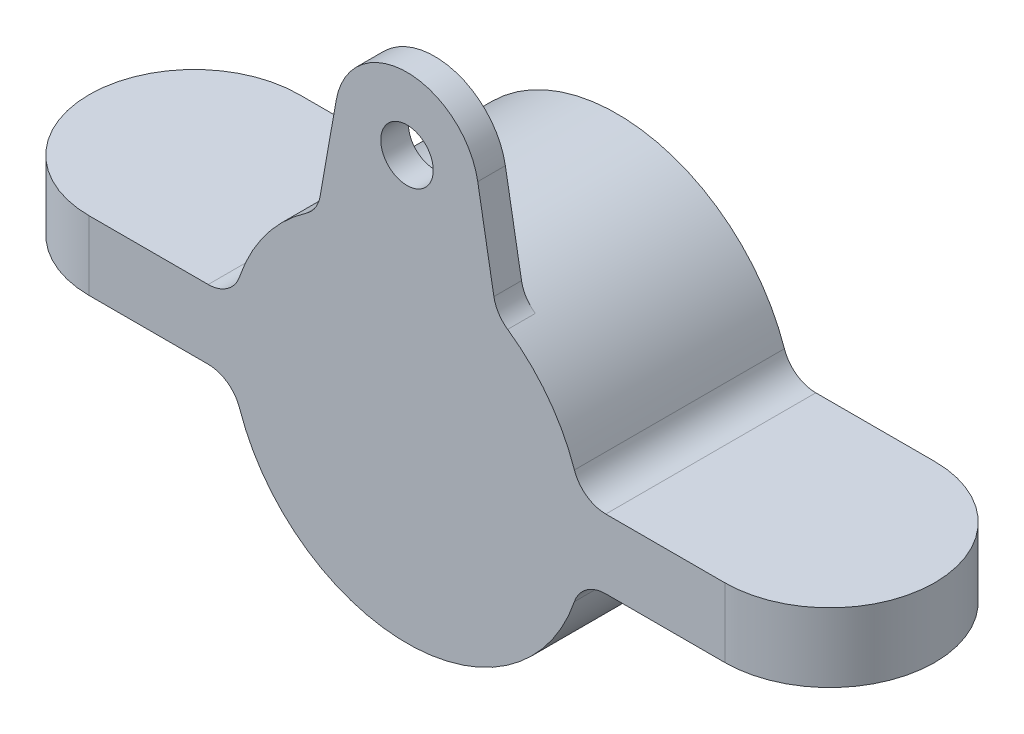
ISO-10303-21;
HEADER;
FILE_DESCRIPTION(('STEP AP214'),'2;1');
FILE_NAME('part.step','',(''),(''),'','','');
FILE_SCHEMA(('AUTOMOTIVE_DESIGN { 1 0 10303 214 1 1 1 1 }'));
ENDSEC;
DATA;
#1=APPLICATION_CONTEXT('core data for automotive mechanical design processes');
#2=APPLICATION_PROTOCOL_DEFINITION('international standard','automotive_design',2000,#1);
#3=PRODUCT_CONTEXT('',#1,'mechanical');
#4=PRODUCT('Part','Part','',(#3));
#5=PRODUCT_RELATED_PRODUCT_CATEGORY('part','',(#4));
#6=PRODUCT_DEFINITION_FORMATION('','',#4);
#7=PRODUCT_DEFINITION_CONTEXT('part definition',#1,'design');
#8=PRODUCT_DEFINITION('design','',#6,#7);
#9=PRODUCT_DEFINITION_SHAPE('','',#8);
#10=(LENGTH_UNIT() NAMED_UNIT(*) SI_UNIT(.MILLI.,.METRE.));
#11=(NAMED_UNIT(*) PLANE_ANGLE_UNIT() SI_UNIT($,.RADIAN.));
#12=(NAMED_UNIT(*) SI_UNIT($,.STERADIAN.) SOLID_ANGLE_UNIT());
#13=UNCERTAINTY_MEASURE_WITH_UNIT(LENGTH_MEASURE(1.E-05),#10,'distance_accuracy_value','');
#14=(GEOMETRIC_REPRESENTATION_CONTEXT(3) GLOBAL_UNCERTAINTY_ASSIGNED_CONTEXT((#13)) GLOBAL_UNIT_ASSIGNED_CONTEXT((#10,
#11,#12)) REPRESENTATION_CONTEXT('',''));
#15=CARTESIAN_POINT('',(0.,0.,0.));
#16=DIRECTION('',(0.,0.,1.));
#17=DIRECTION('',(1.,0.,0.));
#18=AXIS2_PLACEMENT_3D('',#15,#16,#17);
#19=CARTESIAN_POINT('',(-57.5,6.25,-19.));
#20=DIRECTION('',(0.,-1.,0.));
#21=DIRECTION('',(1.,0.,0.));
#22=AXIS2_PLACEMENT_3D('',#19,#20,#21);
#23=CYLINDRICAL_SURFACE('',#22,19.);
#24=DIRECTION('',(0.,-1.,0.));
#25=VECTOR('',#24,1.);
#26=CARTESIAN_POINT('',(-57.5,0.,0.));
#27=LINE('',#26,#25);
#28=CARTESIAN_POINT('',(-57.5,6.25,0.));
#29=VERTEX_POINT('',#28);
#30=CARTESIAN_POINT('',(-57.5,-6.25,0.));
#31=VERTEX_POINT('',#30);
#32=EDGE_CURVE('E240',#29,#31,#27,.T.);
#33=ORIENTED_EDGE('',*,*,#32,.F.);
#34=CARTESIAN_POINT('',(-57.5,6.25,-19.));
#35=DIRECTION('',(0.,1.,0.));
#36=DIRECTION('',(0.,0.,1.));
#37=AXIS2_PLACEMENT_3D('',#34,#35,#36);
#38=CIRCLE('',#37,19.);
#39=CARTESIAN_POINT('',(-57.5,6.25,-38.));
#40=VERTEX_POINT('',#39);
#41=EDGE_CURVE('E246',#40,#29,#38,.T.);
#42=ORIENTED_EDGE('',*,*,#41,.F.);
#43=DIRECTION('',(0.,1.,0.));
#44=VECTOR('',#43,1.);
#45=CARTESIAN_POINT('',(-57.5,6.25,-38.));
#46=LINE('',#45,#44);
#47=CARTESIAN_POINT('',(-57.5,-6.25,-38.));
#48=VERTEX_POINT('',#47);
#49=EDGE_CURVE('E243',#48,#40,#46,.T.);
#50=ORIENTED_EDGE('',*,*,#49,.F.);
#51=CARTESIAN_POINT('',(-57.5,-6.25,-19.));
#52=DIRECTION('',(0.,-1.,0.));
#53=DIRECTION('',(0.,0.,-1.));
#54=AXIS2_PLACEMENT_3D('',#51,#52,#53);
#55=CIRCLE('',#54,19.);
#56=EDGE_CURVE('E249',#31,#48,#55,.T.);
#57=ORIENTED_EDGE('',*,*,#56,.F.);
#58=EDGE_LOOP('',(#33,#42,#50,#57));
#59=FACE_BOUND('',#58,.T.);
#60=ADVANCED_FACE('F34',(#59),#23,.T.);
#61=CARTESIAN_POINT('',(57.5,-6.25,-19.));
#62=DIRECTION('',(0.,1.,0.));
#63=DIRECTION('',(-1.,0.,0.));
#64=AXIS2_PLACEMENT_3D('',#61,#62,#63);
#65=CYLINDRICAL_SURFACE('',#64,19.);
#66=DIRECTION('',(0.,1.,0.));
#67=VECTOR('',#66,1.);
#68=CARTESIAN_POINT('',(57.5,0.,0.));
#69=LINE('',#68,#67);
#70=CARTESIAN_POINT('',(57.5,-6.25,0.));
#71=VERTEX_POINT('',#70);
#72=CARTESIAN_POINT('',(57.5,6.25,0.));
#73=VERTEX_POINT('',#72);
#74=EDGE_CURVE('E214',#71,#73,#69,.T.);
#75=ORIENTED_EDGE('',*,*,#74,.F.);
#76=CARTESIAN_POINT('',(57.5,-6.25,-19.));
#77=DIRECTION('',(0.,-1.,0.));
#78=DIRECTION('',(0.,0.,-1.));
#79=AXIS2_PLACEMENT_3D('',#76,#77,#78);
#80=CIRCLE('',#79,19.);
#81=CARTESIAN_POINT('',(57.5,-6.25,-38.));
#82=VERTEX_POINT('',#81);
#83=EDGE_CURVE('E235',#82,#71,#80,.T.);
#84=ORIENTED_EDGE('',*,*,#83,.F.);
#85=DIRECTION('',(0.,-1.,0.));
#86=VECTOR('',#85,1.);
#87=CARTESIAN_POINT('',(57.5,-6.25,-38.));
#88=LINE('',#87,#86);
#89=CARTESIAN_POINT('',(57.5,6.25,-38.));
#90=VERTEX_POINT('',#89);
#91=EDGE_CURVE('E232',#90,#82,#88,.T.);
#92=ORIENTED_EDGE('',*,*,#91,.F.);
#93=CARTESIAN_POINT('',(57.5,6.25,-19.));
#94=DIRECTION('',(0.,1.,0.));
#95=DIRECTION('',(0.,0.,1.));
#96=AXIS2_PLACEMENT_3D('',#93,#94,#95);
#97=CIRCLE('',#96,19.);
#98=EDGE_CURVE('E238',#73,#90,#97,.T.);
#99=ORIENTED_EDGE('',*,*,#98,.F.);
#100=EDGE_LOOP('',(#75,#84,#92,#99));
#101=FACE_BOUND('',#100,.T.);
#102=ADVANCED_FACE('F319',(#101),#65,.T.);
#103=CARTESIAN_POINT('',(0.,0.,-38.));
#104=DIRECTION('',(0.,0.,1.));
#105=DIRECTION('',(1.,0.,0.));
#106=AXIS2_PLACEMENT_3D('',#103,#104,#105);
#107=CYLINDRICAL_SURFACE('',#106,32.);
#108=CARTESIAN_POINT('',(0.,0.,0.));
#109=DIRECTION('',(0.,0.,1.));
#110=DIRECTION('',(1.,0.,0.));
#111=AXIS2_PLACEMENT_3D('',#108,#109,#110);
#112=CIRCLE('',#111,32.);
#113=CARTESIAN_POINT('',(-18.2153329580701,26.3097252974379,0.));
#114=VERTEX_POINT('',#113);
#115=CARTESIAN_POINT('',(-30.2916570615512,10.3157894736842,0.));
#116=VERTEX_POINT('',#115);
#117=EDGE_CURVE('E196',#114,#116,#112,.T.);
#118=ORIENTED_EDGE('',*,*,#117,.F.);
#119=DIRECTION('',(0.,0.,1.));
#120=VECTOR('',#119,1.);
#121=CARTESIAN_POINT('',(-18.2153329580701,26.3097252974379,-38.));
#122=LINE('',#121,#120);
#123=CARTESIAN_POINT('',(-18.2153329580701,26.3097252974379,-5.));
#124=VERTEX_POINT('',#123);
#125=EDGE_CURVE('E262',#114,#124,#122,.F.);
#126=ORIENTED_EDGE('',*,*,#125,.T.);
#127=CARTESIAN_POINT('',(0.,0.,-5.));
#128=DIRECTION('',(0.,0.,-1.));
#129=DIRECTION('',(1.,0.,0.));
#130=AXIS2_PLACEMENT_3D('',#127,#128,#129);
#131=CIRCLE('',#130,32.);
#132=CARTESIAN_POINT('',(18.2153329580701,26.3097252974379,-5.));
#133=VERTEX_POINT('',#132);
#134=EDGE_CURVE('E172',#124,#133,#131,.T.);
#135=ORIENTED_EDGE('',*,*,#134,.T.);
#136=DIRECTION('',(0.,0.,1.));
#137=VECTOR('',#136,1.);
#138=CARTESIAN_POINT('',(18.2153329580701,26.3097252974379,-38.));
#139=LINE('',#138,#137);
#140=CARTESIAN_POINT('',(18.2153329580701,26.3097252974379,0.));
#141=VERTEX_POINT('',#140);
#142=EDGE_CURVE('E259',#133,#141,#139,.T.);
#143=ORIENTED_EDGE('',*,*,#142,.T.);
#144=CARTESIAN_POINT('',(30.2916570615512,10.3157894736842,0.));
#145=VERTEX_POINT('',#144);
#146=EDGE_CURVE('E217',#145,#141,#112,.T.);
#147=ORIENTED_EDGE('',*,*,#146,.F.);
#148=DIRECTION('',(0.,0.,1.));
#149=VECTOR('',#148,1.);
#150=CARTESIAN_POINT('',(30.2916570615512,10.3157894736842,-38.));
#151=LINE('',#150,#149);
#152=CARTESIAN_POINT('',(30.2916570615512,10.3157894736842,-38.));
#153=VERTEX_POINT('',#152);
#154=EDGE_CURVE('E254',#145,#153,#151,.F.);
#155=ORIENTED_EDGE('',*,*,#154,.T.);
#156=CARTESIAN_POINT('',(0.,0.,-38.));
#157=DIRECTION('',(0.,0.,1.));
#158=DIRECTION('',(1.,0.,0.));
#159=AXIS2_PLACEMENT_3D('',#156,#157,#158);
#160=CIRCLE('',#159,32.);
#161=CARTESIAN_POINT('',(-30.2916570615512,10.3157894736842,-38.));
#162=VERTEX_POINT('',#161);
#163=EDGE_CURVE('E198',#153,#162,#160,.T.);
#164=ORIENTED_EDGE('',*,*,#163,.T.);
#165=DIRECTION('',(0.,0.,1.));
#166=VECTOR('',#165,1.);
#167=CARTESIAN_POINT('',(-30.2916570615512,10.3157894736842,-38.));
#168=LINE('',#167,#166);
#169=EDGE_CURVE('E256',#162,#116,#168,.T.);
#170=ORIENTED_EDGE('',*,*,#169,.T.);
#171=EDGE_LOOP('',(#118,#126,#135,#143,#147,#155,#164,#170));
#172=FACE_BOUND('',#171,.T.);
#173=ADVANCED_FACE('F307',(#172),#107,.T.);
#174=CARTESIAN_POINT('',(31.3837139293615,6.25,-38.));
#175=DIRECTION('',(0.,1.,0.));
#176=DIRECTION('',(0.,0.,1.));
#177=AXIS2_PLACEMENT_3D('',#174,#175,#176);
#178=PLANE('',#177);
#179=DIRECTION('',(-1.,0.,0.));
#180=VECTOR('',#179,1.);
#181=CARTESIAN_POINT('',(31.3837139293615,6.25,-38.));
#182=LINE('',#181,#180);
#183=CARTESIAN_POINT('',(35.9713427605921,6.25,-38.));
#184=VERTEX_POINT('',#183);
#185=EDGE_CURVE('E212',#90,#184,#182,.T.);
#186=ORIENTED_EDGE('',*,*,#185,.T.);
#187=DIRECTION('',(0.,0.,-1.));
#188=VECTOR('',#187,1.);
#189=CARTESIAN_POINT('',(35.9713427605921,6.25,0.));
#190=LINE('',#189,#188);
#191=CARTESIAN_POINT('',(35.9713427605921,6.25,0.));
#192=VERTEX_POINT('',#191);
#193=EDGE_CURVE('E278',#184,#192,#190,.F.);
#194=ORIENTED_EDGE('',*,*,#193,.T.);
#195=DIRECTION('',(-1.,0.,0.));
#196=VECTOR('',#195,1.);
#197=CARTESIAN_POINT('',(31.3837139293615,6.25,0.));
#198=LINE('',#197,#196);
#199=EDGE_CURVE('E202',#73,#192,#198,.T.);
#200=ORIENTED_EDGE('',*,*,#199,.F.);
#201=ORIENTED_EDGE('',*,*,#98,.T.);
#202=EDGE_LOOP('',(#186,#194,#200,#201));
#203=FACE_BOUND('',#202,.T.);
#204=ADVANCED_FACE('F310',(#203),#178,.T.);
#205=CARTESIAN_POINT('',(31.3837139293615,-6.25,-38.));
#206=DIRECTION('',(0.,-1.,0.));
#207=DIRECTION('',(0.,0.,-1.));
#208=AXIS2_PLACEMENT_3D('',#205,#206,#207);
#209=PLANE('',#208);
#210=DIRECTION('',(1.,0.,0.));
#211=VECTOR('',#210,1.);
#212=CARTESIAN_POINT('',(31.3837139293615,-6.25,0.));
#213=LINE('',#212,#211);
#214=CARTESIAN_POINT('',(35.9713427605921,-6.25,0.));
#215=VERTEX_POINT('',#214);
#216=EDGE_CURVE('E226',#215,#71,#213,.T.);
#217=ORIENTED_EDGE('',*,*,#216,.F.);
#218=DIRECTION('',(0.,0.,-1.));
#219=VECTOR('',#218,1.);
#220=CARTESIAN_POINT('',(35.9713427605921,-6.25,-38.));
#221=LINE('',#220,#219);
#222=CARTESIAN_POINT('',(35.9713427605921,-6.25,-38.));
#223=VERTEX_POINT('',#222);
#224=EDGE_CURVE('E276',#215,#223,#221,.T.);
#225=ORIENTED_EDGE('',*,*,#224,.T.);
#226=DIRECTION('',(1.,0.,0.));
#227=VECTOR('',#226,1.);
#228=CARTESIAN_POINT('',(31.3837139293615,-6.25,-38.));
#229=LINE('',#228,#227);
#230=EDGE_CURVE('E210',#223,#82,#229,.T.);
#231=ORIENTED_EDGE('',*,*,#230,.T.);
#232=ORIENTED_EDGE('',*,*,#83,.T.);
#233=EDGE_LOOP('',(#217,#225,#231,#232));
#234=FACE_BOUND('',#233,.T.);
#235=ADVANCED_FACE('F322',(#234),#209,.T.);
#236=CARTESIAN_POINT('',(0.,0.,-38.));
#237=DIRECTION('',(0.,0.,1.));
#238=DIRECTION('',(1.,0.,0.));
#239=AXIS2_PLACEMENT_3D('',#236,#237,#238);
#240=CYLINDRICAL_SURFACE('',#239,32.);
#241=CARTESIAN_POINT('',(0.,0.,0.));
#242=DIRECTION('',(0.,0.,1.));
#243=DIRECTION('',(1.,0.,0.));
#244=AXIS2_PLACEMENT_3D('',#241,#242,#243);
#245=CIRCLE('',#244,32.);
#246=CARTESIAN_POINT('',(-30.2916570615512,-10.3157894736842,0.));
#247=VERTEX_POINT('',#246);
#248=CARTESIAN_POINT('',(30.2916570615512,-10.3157894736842,0.));
#249=VERTEX_POINT('',#248);
#250=EDGE_CURVE('E223',#247,#249,#245,.T.);
#251=ORIENTED_EDGE('',*,*,#250,.F.);
#252=DIRECTION('',(0.,0.,1.));
#253=VECTOR('',#252,1.);
#254=CARTESIAN_POINT('',(-30.2916570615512,-10.3157894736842,-38.));
#255=LINE('',#254,#253);
#256=CARTESIAN_POINT('',(-30.2916570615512,-10.3157894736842,-38.));
#257=VERTEX_POINT('',#256);
#258=EDGE_CURVE('E274',#247,#257,#255,.F.);
#259=ORIENTED_EDGE('',*,*,#258,.T.);
#260=CARTESIAN_POINT('',(0.,0.,-38.));
#261=DIRECTION('',(0.,0.,1.));
#262=DIRECTION('',(1.,0.,0.));
#263=AXIS2_PLACEMENT_3D('',#260,#261,#262);
#264=CIRCLE('',#263,32.);
#265=CARTESIAN_POINT('',(30.2916570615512,-10.3157894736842,-38.));
#266=VERTEX_POINT('',#265);
#267=EDGE_CURVE('E207',#257,#266,#264,.T.);
#268=ORIENTED_EDGE('',*,*,#267,.T.);
#269=DIRECTION('',(0.,0.,1.));
#270=VECTOR('',#269,1.);
#271=CARTESIAN_POINT('',(30.2916570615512,-10.3157894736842,-38.));
#272=LINE('',#271,#270);
#273=EDGE_CURVE('E271',#266,#249,#272,.T.);
#274=ORIENTED_EDGE('',*,*,#273,.T.);
#275=EDGE_LOOP('',(#251,#259,#268,#274));
#276=FACE_BOUND('',#275,.T.);
#277=ADVANCED_FACE('F331',(#276),#240,.T.);
#278=CARTESIAN_POINT('',(-31.3837139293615,-6.25,-38.));
#279=DIRECTION('',(0.,-1.,0.));
#280=DIRECTION('',(0.,0.,-1.));
#281=AXIS2_PLACEMENT_3D('',#278,#279,#280);
#282=PLANE('',#281);
#283=DIRECTION('',(1.,0.,0.));
#284=VECTOR('',#283,1.);
#285=CARTESIAN_POINT('',(-31.3837139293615,-6.25,-38.));
#286=LINE('',#285,#284);
#287=CARTESIAN_POINT('',(-35.9713427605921,-6.25,-38.));
#288=VERTEX_POINT('',#287);
#289=EDGE_CURVE('E204',#48,#288,#286,.T.);
#290=ORIENTED_EDGE('',*,*,#289,.T.);
#291=DIRECTION('',(0.,0.,-1.));
#292=VECTOR('',#291,1.);
#293=CARTESIAN_POINT('',(-35.9713427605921,-6.25,0.));
#294=LINE('',#293,#292);
#295=CARTESIAN_POINT('',(-35.9713427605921,-6.25,0.));
#296=VERTEX_POINT('',#295);
#297=EDGE_CURVE('E268',#288,#296,#294,.F.);
#298=ORIENTED_EDGE('',*,*,#297,.T.);
#299=DIRECTION('',(1.,0.,0.));
#300=VECTOR('',#299,1.);
#301=CARTESIAN_POINT('',(-31.3837139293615,-6.25,0.));
#302=LINE('',#301,#300);
#303=EDGE_CURVE('E220',#31,#296,#302,.T.);
#304=ORIENTED_EDGE('',*,*,#303,.F.);
#305=ORIENTED_EDGE('',*,*,#56,.T.);
#306=EDGE_LOOP('',(#290,#298,#304,#305));
#307=FACE_BOUND('',#306,.T.);
#308=ADVANCED_FACE('F337',(#307),#282,.T.);
#309=CARTESIAN_POINT('',(-31.3837139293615,6.25,-38.));
#310=DIRECTION('',(0.,1.,0.));
#311=DIRECTION('',(0.,0.,1.));
#312=AXIS2_PLACEMENT_3D('',#309,#310,#311);
#313=PLANE('',#312);
#314=DIRECTION('',(-1.,0.,0.));
#315=VECTOR('',#314,1.);
#316=CARTESIAN_POINT('',(-31.3837139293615,6.25,0.));
#317=LINE('',#316,#315);
#318=CARTESIAN_POINT('',(-35.9713427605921,6.25,0.));
#319=VERTEX_POINT('',#318);
#320=EDGE_CURVE('E218',#319,#29,#317,.T.);
#321=ORIENTED_EDGE('',*,*,#320,.F.);
#322=DIRECTION('',(0.,0.,-1.));
#323=VECTOR('',#322,1.);
#324=CARTESIAN_POINT('',(-35.9713427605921,6.25,-38.));
#325=LINE('',#324,#323);
#326=CARTESIAN_POINT('',(-35.9713427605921,6.25,-38.));
#327=VERTEX_POINT('',#326);
#328=EDGE_CURVE('E266',#319,#327,#325,.T.);
#329=ORIENTED_EDGE('',*,*,#328,.T.);
#330=DIRECTION('',(-1.,0.,0.));
#331=VECTOR('',#330,1.);
#332=CARTESIAN_POINT('',(-31.3837139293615,6.25,-38.));
#333=LINE('',#332,#331);
#334=EDGE_CURVE('E201',#327,#40,#333,.T.);
#335=ORIENTED_EDGE('',*,*,#334,.T.);
#336=ORIENTED_EDGE('',*,*,#41,.T.);
#337=EDGE_LOOP('',(#321,#329,#335,#336));
#338=FACE_BOUND('',#337,.T.);
#339=ADVANCED_FACE('F381',(#338),#313,.T.);
#340=CARTESIAN_POINT('',(0.,0.,-38.));
#341=DIRECTION('',(0.,0.,1.));
#342=DIRECTION('',(1.,0.,0.));
#343=AXIS2_PLACEMENT_3D('',#340,#341,#342);
#344=PLANE('',#343);
#345=ORIENTED_EDGE('',*,*,#289,.F.);
#346=ORIENTED_EDGE('',*,*,#49,.T.);
#347=ORIENTED_EDGE('',*,*,#334,.F.);
#348=CARTESIAN_POINT('',(-35.9713427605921,12.25,-38.));
#349=DIRECTION('',(0.,0.,1.));
#350=DIRECTION('',(1.,0.,0.));
#351=AXIS2_PLACEMENT_3D('',#348,#349,#350);
#352=CIRCLE('',#351,6.);
#353=EDGE_CURVE('E290',#327,#162,#352,.T.);
#354=ORIENTED_EDGE('',*,*,#353,.T.);
#355=ORIENTED_EDGE('',*,*,#163,.F.);
#356=CARTESIAN_POINT('',(35.9713427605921,12.25,-38.));
#357=DIRECTION('',(0.,0.,1.));
#358=DIRECTION('',(1.,0.,0.));
#359=AXIS2_PLACEMENT_3D('',#356,#357,#358);
#360=CIRCLE('',#359,6.);
#361=EDGE_CURVE('E11',#153,#184,#360,.T.);
#362=ORIENTED_EDGE('',*,*,#361,.T.);
#363=ORIENTED_EDGE('',*,*,#185,.F.);
#364=ORIENTED_EDGE('',*,*,#91,.T.);
#365=ORIENTED_EDGE('',*,*,#230,.F.);
#366=CARTESIAN_POINT('',(35.9713427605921,-12.25,-38.));
#367=DIRECTION('',(0.,0.,1.));
#368=DIRECTION('',(1.,0.,0.));
#369=AXIS2_PLACEMENT_3D('',#366,#367,#368);
#370=CIRCLE('',#369,6.);
#371=EDGE_CURVE('E298',#223,#266,#370,.T.);
#372=ORIENTED_EDGE('',*,*,#371,.T.);
#373=ORIENTED_EDGE('',*,*,#267,.F.);
#374=CARTESIAN_POINT('',(-35.9713427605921,-12.25,-38.));
#375=DIRECTION('',(0.,0.,1.));
#376=DIRECTION('',(1.,0.,0.));
#377=AXIS2_PLACEMENT_3D('',#374,#375,#376);
#378=CIRCLE('',#377,6.);
#379=EDGE_CURVE('E294',#257,#288,#378,.T.);
#380=ORIENTED_EDGE('',*,*,#379,.T.);
#381=EDGE_LOOP('',(#345,#346,#347,#354,#355,#362,#363,#364,#365,#372,#373,#380));
#382=FACE_BOUND('',#381,.T.);
#383=ADVANCED_FACE('F313',(#382),#344,.F.);
#384=CARTESIAN_POINT('',(0.,0.,0.));
#385=DIRECTION('',(0.,0.,1.));
#386=DIRECTION('',(1.,0.,0.));
#387=AXIS2_PLACEMENT_3D('',#384,#385,#386);
#388=PLANE('',#387);
#389=ORIENTED_EDGE('',*,*,#117,.T.);
#390=CARTESIAN_POINT('',(-35.9713427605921,12.25,0.));
#391=DIRECTION('',(0.,0.,1.));
#392=DIRECTION('',(1.,0.,0.));
#393=AXIS2_PLACEMENT_3D('',#390,#391,#392);
#394=CIRCLE('',#393,6.);
#395=EDGE_CURVE('E288',#116,#319,#394,.F.);
#396=ORIENTED_EDGE('',*,*,#395,.T.);
#397=ORIENTED_EDGE('',*,*,#320,.T.);
#398=ORIENTED_EDGE('',*,*,#32,.T.);
#399=ORIENTED_EDGE('',*,*,#303,.T.);
#400=CARTESIAN_POINT('',(-35.9713427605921,-12.25,0.));
#401=DIRECTION('',(0.,0.,1.));
#402=DIRECTION('',(1.,0.,0.));
#403=AXIS2_PLACEMENT_3D('',#400,#401,#402);
#404=CIRCLE('',#403,6.);
#405=EDGE_CURVE('E292',#296,#247,#404,.F.);
#406=ORIENTED_EDGE('',*,*,#405,.T.);
#407=ORIENTED_EDGE('',*,*,#250,.T.);
#408=CARTESIAN_POINT('',(35.9713427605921,-12.25,0.));
#409=DIRECTION('',(0.,0.,1.));
#410=DIRECTION('',(1.,0.,0.));
#411=AXIS2_PLACEMENT_3D('',#408,#409,#410);
#412=CIRCLE('',#411,6.);
#413=EDGE_CURVE('E296',#249,#215,#412,.F.);
#414=ORIENTED_EDGE('',*,*,#413,.T.);
#415=ORIENTED_EDGE('',*,*,#216,.T.);
#416=ORIENTED_EDGE('',*,*,#74,.T.);
#417=ORIENTED_EDGE('',*,*,#199,.T.);
#418=CARTESIAN_POINT('',(35.9713427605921,12.25,0.));
#419=DIRECTION('',(0.,0.,1.));
#420=DIRECTION('',(1.,0.,0.));
#421=AXIS2_PLACEMENT_3D('',#418,#419,#420);
#422=CIRCLE('',#421,6.);
#423=EDGE_CURVE('E42',#192,#145,#422,.F.);
#424=ORIENTED_EDGE('',*,*,#423,.T.);
#425=ORIENTED_EDGE('',*,*,#146,.T.);
#426=CARTESIAN_POINT('',(21.6307078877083,31.2427987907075,0.));
#427=DIRECTION('',(0.,0.,1.));
#428=DIRECTION('',(1.,0.,0.));
#429=AXIS2_PLACEMENT_3D('',#426,#427,#428);
#430=CIRCLE('',#429,6.);
#431=CARTESIAN_POINT('',(15.721861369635,30.200909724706,0.));
#432=VERTEX_POINT('',#431);
#433=EDGE_CURVE('E284',#141,#432,#430,.F.);
#434=ORIENTED_EDGE('',*,*,#433,.T.);
#435=DIRECTION('',(-0.173648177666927,0.984807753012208,0.));
#436=VECTOR('',#435,1.);
#437=CARTESIAN_POINT('',(12.8025007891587,46.7574263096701,0.));
#438=LINE('',#437,#436);
#439=CARTESIAN_POINT('',(12.8025007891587,46.7574263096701,0.));
#440=VERTEX_POINT('',#439);
#441=EDGE_CURVE('E189',#432,#440,#438,.T.);
#442=ORIENTED_EDGE('',*,*,#441,.T.);
#443=CARTESIAN_POINT('',(0.,44.5,0.));
#444=DIRECTION('',(0.,0.,1.));
#445=DIRECTION('',(-1.,0.,0.));
#446=AXIS2_PLACEMENT_3D('',#443,#444,#445);
#447=CIRCLE('',#446,13.);
#448=CARTESIAN_POINT('',(-12.8025007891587,46.7574263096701,0.));
#449=VERTEX_POINT('',#448);
#450=EDGE_CURVE('E179',#440,#449,#447,.T.);
#451=ORIENTED_EDGE('',*,*,#450,.T.);
#452=DIRECTION('',(-0.173648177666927,-0.984807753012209,0.));
#453=VECTOR('',#452,1.);
#454=CARTESIAN_POINT('',(-16.1789319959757,27.6087333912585,0.));
#455=LINE('',#454,#453);
#456=CARTESIAN_POINT('',(-15.721861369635,30.200909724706,0.));
#457=VERTEX_POINT('',#456);
#458=EDGE_CURVE('E193',#449,#457,#455,.T.);
#459=ORIENTED_EDGE('',*,*,#458,.T.);
#460=CARTESIAN_POINT('',(-21.6307078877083,31.2427987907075,0.));
#461=DIRECTION('',(0.,0.,1.));
#462=DIRECTION('',(1.,0.,0.));
#463=AXIS2_PLACEMENT_3D('',#460,#461,#462);
#464=CIRCLE('',#463,6.);
#465=EDGE_CURVE('E280',#457,#114,#464,.F.);
#466=ORIENTED_EDGE('',*,*,#465,.T.);
#467=EDGE_LOOP('',(#389,#396,#397,#398,#399,#406,#407,#414,#415,#416,#417,#424,#425,#434,#442,
#451,#459,#466));
#468=FACE_BOUND('',#467,.T.);
#469=CARTESIAN_POINT('',(0.,44.5,0.));
#470=DIRECTION('',(0.,0.,1.));
#471=DIRECTION('',(1.,0.,0.));
#472=AXIS2_PLACEMENT_3D('',#469,#470,#471);
#473=CIRCLE('',#472,4.75);
#474=CARTESIAN_POINT('',(4.75,44.5,0.));
#475=VERTEX_POINT('',#474);
#476=EDGE_CURVE('E362',#475,#475,#473,.T.);
#477=ORIENTED_EDGE('',*,*,#476,.F.);
#478=EDGE_LOOP('',(#477));
#479=FACE_BOUND('',#478,.T.);
#480=ADVANCED_FACE('F302',(#468,#479),#388,.T.);
#481=CARTESIAN_POINT('',(-16.1789319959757,27.6087333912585,-5.));
#482=DIRECTION('',(-0.984807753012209,0.173648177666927,0.));
#483=DIRECTION('',(-0.173648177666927,-0.984807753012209,0.));
#484=AXIS2_PLACEMENT_3D('',#481,#482,#483);
#485=PLANE('',#484);
#486=DIRECTION('',(-0.173648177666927,-0.984807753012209,0.));
#487=VECTOR('',#486,1.);
#488=CARTESIAN_POINT('',(-16.1789319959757,27.6087333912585,-5.));
#489=LINE('',#488,#487);
#490=CARTESIAN_POINT('',(-12.8025007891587,46.7574263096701,-5.));
#491=VERTEX_POINT('',#490);
#492=CARTESIAN_POINT('',(-15.721861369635,30.200909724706,-5.));
#493=VERTEX_POINT('',#492);
#494=EDGE_CURVE('E181',#491,#493,#489,.T.);
#495=ORIENTED_EDGE('',*,*,#494,.T.);
#496=DIRECTION('',(0.,0.,-1.));
#497=VECTOR('',#496,1.);
#498=CARTESIAN_POINT('',(-15.721861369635,30.200909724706,0.));
#499=LINE('',#498,#497);
#500=EDGE_CURVE('E251',#493,#457,#499,.F.);
#501=ORIENTED_EDGE('',*,*,#500,.T.);
#502=ORIENTED_EDGE('',*,*,#458,.F.);
#503=DIRECTION('',(0.,0.,1.));
#504=VECTOR('',#503,1.);
#505=CARTESIAN_POINT('',(-12.8025007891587,46.7574263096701,-5.));
#506=LINE('',#505,#504);
#507=EDGE_CURVE('E180',#491,#449,#506,.T.);
#508=ORIENTED_EDGE('',*,*,#507,.F.);
#509=EDGE_LOOP('',(#495,#501,#502,#508));
#510=FACE_BOUND('',#509,.T.);
#511=ADVANCED_FACE('F358',(#510),#485,.T.);
#512=CARTESIAN_POINT('',(0.,44.5,-5.));
#513=DIRECTION('',(0.,0.,1.));
#514=DIRECTION('',(1.,0.,0.));
#515=AXIS2_PLACEMENT_3D('',#512,#513,#514);
#516=CYLINDRICAL_SURFACE('',#515,13.);
#517=ORIENTED_EDGE('',*,*,#450,.F.);
#518=DIRECTION('',(0.,0.,1.));
#519=VECTOR('',#518,1.);
#520=CARTESIAN_POINT('',(12.8025007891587,46.7574263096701,-5.));
#521=LINE('',#520,#519);
#522=CARTESIAN_POINT('',(12.8025007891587,46.7574263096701,-5.));
#523=VERTEX_POINT('',#522);
#524=EDGE_CURVE('E163',#523,#440,#521,.T.);
#525=ORIENTED_EDGE('',*,*,#524,.F.);
#526=CARTESIAN_POINT('',(0.,44.5,-5.));
#527=DIRECTION('',(0.,0.,1.));
#528=DIRECTION('',(-1.,0.,0.));
#529=AXIS2_PLACEMENT_3D('',#526,#527,#528);
#530=CIRCLE('',#529,13.);
#531=EDGE_CURVE('E171',#523,#491,#530,.T.);
#532=ORIENTED_EDGE('',*,*,#531,.T.);
#533=ORIENTED_EDGE('',*,*,#507,.T.);
#534=EDGE_LOOP('',(#517,#525,#532,#533));
#535=FACE_BOUND('',#534,.T.);
#536=ADVANCED_FACE('F176',(#535),#516,.T.);
#537=CARTESIAN_POINT('',(12.8025007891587,46.7574263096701,-5.));
#538=DIRECTION('',(0.984807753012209,0.173648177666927,0.));
#539=DIRECTION('',(-0.173648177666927,0.984807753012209,0.));
#540=AXIS2_PLACEMENT_3D('',#537,#538,#539);
#541=PLANE('',#540);
#542=ORIENTED_EDGE('',*,*,#441,.F.);
#543=DIRECTION('',(0.,0.,-1.));
#544=VECTOR('',#543,1.);
#545=CARTESIAN_POINT('',(15.721861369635,30.200909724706,-5.));
#546=LINE('',#545,#544);
#547=CARTESIAN_POINT('',(15.721861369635,30.200909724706,-5.));
#548=VERTEX_POINT('',#547);
#549=EDGE_CURVE('E166',#432,#548,#546,.T.);
#550=ORIENTED_EDGE('',*,*,#549,.T.);
#551=DIRECTION('',(-0.173648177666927,0.984807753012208,0.));
#552=VECTOR('',#551,1.);
#553=CARTESIAN_POINT('',(12.8025007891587,46.7574263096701,-5.));
#554=LINE('',#553,#552);
#555=EDGE_CURVE('E159',#548,#523,#554,.T.);
#556=ORIENTED_EDGE('',*,*,#555,.T.);
#557=ORIENTED_EDGE('',*,*,#524,.T.);
#558=EDGE_LOOP('',(#542,#550,#556,#557));
#559=FACE_BOUND('',#558,.T.);
#560=ADVANCED_FACE('F162',(#559),#541,.T.);
#561=CARTESIAN_POINT('',(0.,0.,-5.));
#562=DIRECTION('',(0.,0.,1.));
#563=DIRECTION('',(1.,0.,0.));
#564=AXIS2_PLACEMENT_3D('',#561,#562,#563);
#565=PLANE('',#564);
#566=CARTESIAN_POINT('',(0.,44.5,-5.));
#567=DIRECTION('',(0.,0.,1.));
#568=DIRECTION('',(1.,0.,0.));
#569=AXIS2_PLACEMENT_3D('',#566,#567,#568);
#570=CIRCLE('',#569,4.75);
#571=CARTESIAN_POINT('',(4.75,44.5,-5.));
#572=VERTEX_POINT('',#571);
#573=EDGE_CURVE('E191',#572,#572,#570,.T.);
#574=ORIENTED_EDGE('',*,*,#573,.T.);
#575=EDGE_LOOP('',(#574));
#576=FACE_BOUND('',#575,.T.);
#577=ORIENTED_EDGE('',*,*,#134,.F.);
#578=CARTESIAN_POINT('',(-21.6307078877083,31.2427987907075,-5.));
#579=DIRECTION('',(0.,0.,1.));
#580=DIRECTION('',(1.,0.,0.));
#581=AXIS2_PLACEMENT_3D('',#578,#579,#580);
#582=CIRCLE('',#581,6.);
#583=EDGE_CURVE('E282',#124,#493,#582,.T.);
#584=ORIENTED_EDGE('',*,*,#583,.T.);
#585=ORIENTED_EDGE('',*,*,#494,.F.);
#586=ORIENTED_EDGE('',*,*,#531,.F.);
#587=ORIENTED_EDGE('',*,*,#555,.F.);
#588=CARTESIAN_POINT('',(21.6307078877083,31.2427987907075,-5.));
#589=DIRECTION('',(0.,0.,1.));
#590=DIRECTION('',(1.,0.,0.));
#591=AXIS2_PLACEMENT_3D('',#588,#589,#590);
#592=CIRCLE('',#591,6.);
#593=EDGE_CURVE('E286',#548,#133,#592,.T.);
#594=ORIENTED_EDGE('',*,*,#593,.T.);
#595=EDGE_LOOP('',(#577,#584,#585,#586,#587,#594));
#596=FACE_BOUND('',#595,.T.);
#597=ADVANCED_FACE('F183',(#576,#596),#565,.F.);
#598=CARTESIAN_POINT('',(0.,44.5,-5.));
#599=DIRECTION('',(0.,0.,1.));
#600=DIRECTION('',(1.,0.,0.));
#601=AXIS2_PLACEMENT_3D('',#598,#599,#600);
#602=CYLINDRICAL_SURFACE('',#601,4.75);
#603=ORIENTED_EDGE('',*,*,#573,.F.);
#604=EDGE_LOOP('',(#603));
#605=FACE_BOUND('',#604,.T.);
#606=ORIENTED_EDGE('',*,*,#476,.T.);
#607=EDGE_LOOP('',(#606));
#608=FACE_BOUND('',#607,.T.);
#609=ADVANCED_FACE('F369',(#605,#608),#602,.F.);
#610=CARTESIAN_POINT('',(-21.6307078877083,31.2427987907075,-38.));
#611=DIRECTION('',(0.,0.,1.));
#612=DIRECTION('',(1.,0.,0.));
#613=AXIS2_PLACEMENT_3D('',#610,#611,#612);
#614=CYLINDRICAL_SURFACE('',#613,6.);
#615=ORIENTED_EDGE('',*,*,#583,.F.);
#616=ORIENTED_EDGE('',*,*,#125,.F.);
#617=ORIENTED_EDGE('',*,*,#465,.F.);
#618=ORIENTED_EDGE('',*,*,#500,.F.);
#619=EDGE_LOOP('',(#615,#616,#617,#618));
#620=FACE_BOUND('',#619,.T.);
#621=ADVANCED_FACE('F356',(#620),#614,.F.);
#622=CARTESIAN_POINT('',(21.6307078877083,31.2427987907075,-38.));
#623=DIRECTION('',(0.,0.,1.));
#624=DIRECTION('',(1.,0.,0.));
#625=AXIS2_PLACEMENT_3D('',#622,#623,#624);
#626=CYLINDRICAL_SURFACE('',#625,6.);
#627=ORIENTED_EDGE('',*,*,#593,.F.);
#628=ORIENTED_EDGE('',*,*,#549,.F.);
#629=ORIENTED_EDGE('',*,*,#433,.F.);
#630=ORIENTED_EDGE('',*,*,#142,.F.);
#631=EDGE_LOOP('',(#627,#628,#629,#630));
#632=FACE_BOUND('',#631,.T.);
#633=ADVANCED_FACE('F360',(#632),#626,.F.);
#634=CARTESIAN_POINT('',(-35.9713427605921,12.25,-38.));
#635=DIRECTION('',(0.,0.,1.));
#636=DIRECTION('',(1.,0.,0.));
#637=AXIS2_PLACEMENT_3D('',#634,#635,#636);
#638=CYLINDRICAL_SURFACE('',#637,6.);
#639=ORIENTED_EDGE('',*,*,#353,.F.);
#640=ORIENTED_EDGE('',*,*,#328,.F.);
#641=ORIENTED_EDGE('',*,*,#395,.F.);
#642=ORIENTED_EDGE('',*,*,#169,.F.);
#643=EDGE_LOOP('',(#639,#640,#641,#642));
#644=FACE_BOUND('',#643,.T.);
#645=ADVANCED_FACE('F349',(#644),#638,.F.);
#646=CARTESIAN_POINT('',(-35.9713427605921,-12.25,-38.));
#647=DIRECTION('',(0.,0.,1.));
#648=DIRECTION('',(1.,0.,0.));
#649=AXIS2_PLACEMENT_3D('',#646,#647,#648);
#650=CYLINDRICAL_SURFACE('',#649,6.);
#651=ORIENTED_EDGE('',*,*,#379,.F.);
#652=ORIENTED_EDGE('',*,*,#258,.F.);
#653=ORIENTED_EDGE('',*,*,#405,.F.);
#654=ORIENTED_EDGE('',*,*,#297,.F.);
#655=EDGE_LOOP('',(#651,#652,#653,#654));
#656=FACE_BOUND('',#655,.T.);
#657=ADVANCED_FACE('F334',(#656),#650,.F.);
#658=CARTESIAN_POINT('',(35.9713427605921,-12.25,-38.));
#659=DIRECTION('',(0.,0.,1.));
#660=DIRECTION('',(1.,0.,0.));
#661=AXIS2_PLACEMENT_3D('',#658,#659,#660);
#662=CYLINDRICAL_SURFACE('',#661,6.);
#663=ORIENTED_EDGE('',*,*,#371,.F.);
#664=ORIENTED_EDGE('',*,*,#224,.F.);
#665=ORIENTED_EDGE('',*,*,#413,.F.);
#666=ORIENTED_EDGE('',*,*,#273,.F.);
#667=EDGE_LOOP('',(#663,#664,#665,#666));
#668=FACE_BOUND('',#667,.T.);
#669=ADVANCED_FACE('F325',(#668),#662,.F.);
#670=CARTESIAN_POINT('',(35.9713427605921,12.25,-38.));
#671=DIRECTION('',(0.,0.,1.));
#672=DIRECTION('',(1.,0.,0.));
#673=AXIS2_PLACEMENT_3D('',#670,#671,#672);
#674=CYLINDRICAL_SURFACE('',#673,6.);
#675=ORIENTED_EDGE('',*,*,#361,.F.);
#676=ORIENTED_EDGE('',*,*,#154,.F.);
#677=ORIENTED_EDGE('',*,*,#423,.F.);
#678=ORIENTED_EDGE('',*,*,#193,.F.);
#679=EDGE_LOOP('',(#675,#676,#677,#678));
#680=FACE_BOUND('',#679,.T.);
#681=ADVANCED_FACE('F36',(#680),#674,.F.);
#682=CLOSED_SHELL('',(#60,#102,#173,#204,#235,#277,#308,#339,#383,#480,#511,#536,#560,#597,#609,
#621,#633,#645,#657,#669,#681));
#683=MANIFOLD_SOLID_BREP('B2',#682);
#684=ADVANCED_BREP_SHAPE_REPRESENTATION('',(#18,#683),#14);
#685=SHAPE_DEFINITION_REPRESENTATION(#9,#684);
ENDSEC;
END-ISO-10303-21;
